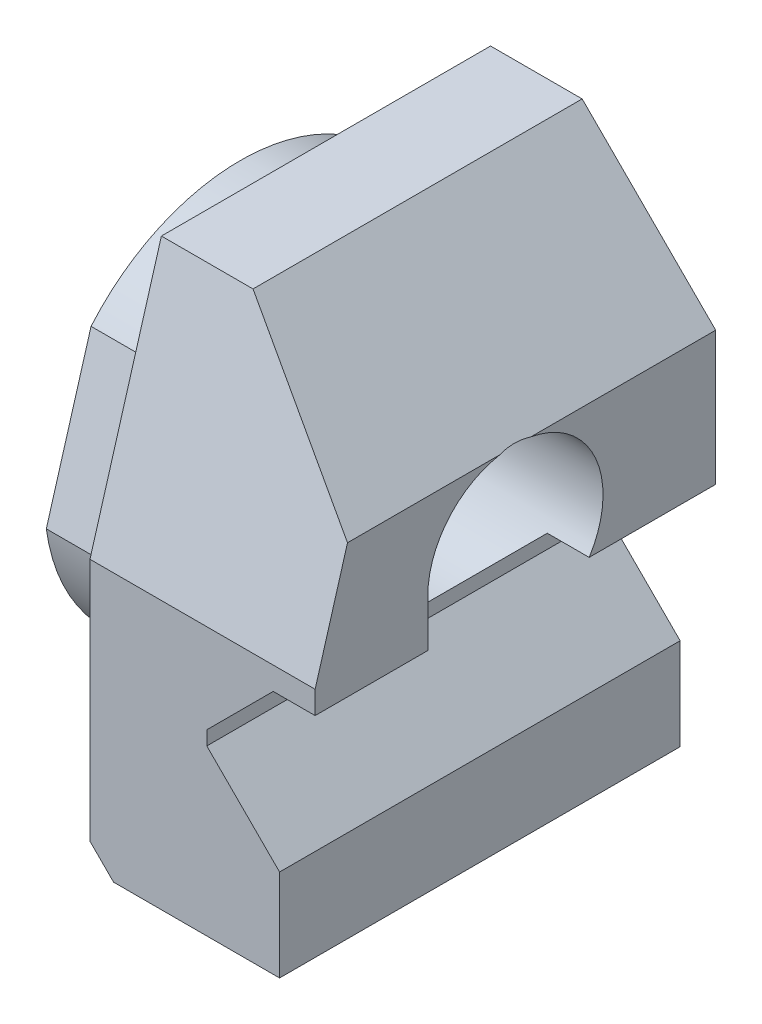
ISO-10303-21;
HEADER;
FILE_DESCRIPTION(('STEP AP214'),'2;1');
FILE_NAME('part.step','',(''),(''),'','','');
FILE_SCHEMA(('AUTOMOTIVE_DESIGN { 1 0 10303 214 1 1 1 1 }'));
ENDSEC;
DATA;
#1=APPLICATION_CONTEXT('core data for automotive mechanical design processes');
#2=APPLICATION_PROTOCOL_DEFINITION('international standard','automotive_design',2000,#1);
#3=PRODUCT_CONTEXT('',#1,'mechanical');
#4=PRODUCT('Part','Part','',(#3));
#5=PRODUCT_RELATED_PRODUCT_CATEGORY('part','',(#4));
#6=PRODUCT_DEFINITION_FORMATION('','',#4);
#7=PRODUCT_DEFINITION_CONTEXT('part definition',#1,'design');
#8=PRODUCT_DEFINITION('design','',#6,#7);
#9=PRODUCT_DEFINITION_SHAPE('','',#8);
#10=(LENGTH_UNIT() NAMED_UNIT(*) SI_UNIT(.MILLI.,.METRE.));
#11=(NAMED_UNIT(*) PLANE_ANGLE_UNIT() SI_UNIT($,.RADIAN.));
#12=(NAMED_UNIT(*) SI_UNIT($,.STERADIAN.) SOLID_ANGLE_UNIT());
#13=UNCERTAINTY_MEASURE_WITH_UNIT(LENGTH_MEASURE(1.E-05),#10,'distance_accuracy_value','');
#14=(GEOMETRIC_REPRESENTATION_CONTEXT(3) GLOBAL_UNCERTAINTY_ASSIGNED_CONTEXT((#13)) GLOBAL_UNIT_ASSIGNED_CONTEXT((#10,
#11,#12)) REPRESENTATION_CONTEXT('',''));
#15=CARTESIAN_POINT('',(0.,0.,0.));
#16=DIRECTION('',(0.,0.,1.));
#17=DIRECTION('',(1.,0.,0.));
#18=AXIS2_PLACEMENT_3D('',#15,#16,#17);
#19=CARTESIAN_POINT('',(-21.07565,12.954,15.24));
#20=DIRECTION('',(1.,0.,0.));
#21=DIRECTION('',(0.,1.,0.));
#22=AXIS2_PLACEMENT_3D('',#19,#20,#21);
#23=PLANE('',#22);
#24=DIRECTION('',(0.,-1.,0.));
#25=VECTOR('',#24,1.);
#26=CARTESIAN_POINT('',(-21.07565,12.954,15.24));
#27=LINE('',#26,#25);
#28=CARTESIAN_POINT('',(-21.07565,3.66211280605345,15.24));
#29=VERTEX_POINT('',#28);
#30=CARTESIAN_POINT('',(-21.07565,-5.62977438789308,15.24));
#31=VERTEX_POINT('',#30);
#32=EDGE_CURVE('E385',#29,#31,#27,.T.);
#33=ORIENTED_EDGE('',*,*,#32,.F.);
#34=DIRECTION('',(0.,0.959797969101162,-0.280691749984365));
#35=VECTOR('',#34,1.);
#36=CARTESIAN_POINT('',(-21.07565,12.2219121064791,12.7366970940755));
#37=LINE('',#36,#35);
#38=CARTESIAN_POINT('',(-21.07565,12.954,12.5225988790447));
#39=VERTEX_POINT('',#38);
#40=EDGE_CURVE('E352',#29,#39,#37,.T.);
#41=ORIENTED_EDGE('',*,*,#40,.T.);
#42=DIRECTION('',(0.,0.,-1.));
#43=VECTOR('',#42,1.);
#44=CARTESIAN_POINT('',(-21.07565,12.954,15.24));
#45=LINE('',#44,#43);
#46=CARTESIAN_POINT('',(-21.07565,12.954,0.));
#47=VERTEX_POINT('',#46);
#48=EDGE_CURVE('E456',#39,#47,#45,.T.);
#49=ORIENTED_EDGE('',*,*,#48,.T.);
#50=DIRECTION('',(0.,-1.,0.));
#51=VECTOR('',#50,1.);
#52=CARTESIAN_POINT('',(-21.07565,12.954,0.));
#53=LINE('',#52,#51);
#54=CARTESIAN_POINT('',(-21.07565,-5.62977438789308,0.));
#55=VERTEX_POINT('',#54);
#56=EDGE_CURVE('E553',#47,#55,#53,.T.);
#57=ORIENTED_EDGE('',*,*,#56,.T.);
#58=DIRECTION('',(0.,0.,-1.));
#59=VECTOR('',#58,1.);
#60=CARTESIAN_POINT('',(-21.07565,-5.62977438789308,15.24));
#61=LINE('',#60,#59);
#62=EDGE_CURVE('E463',#31,#55,#61,.T.);
#63=ORIENTED_EDGE('',*,*,#62,.F.);
#64=EDGE_LOOP('',(#33,#41,#49,#57,#63));
#65=FACE_BOUND('',#64,.T.);
#66=CARTESIAN_POINT('',(-21.07565,4.59292261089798,7.62));
#67=DIRECTION('',(1.,0.,0.));
#68=DIRECTION('',(0.,1.,0.));
#69=AXIS2_PLACEMENT_3D('',#66,#67,#68);
#70=CIRCLE('',#69,7.44397130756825);
#71=CARTESIAN_POINT('',(-21.07565,3.51832834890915,0.254));
#72=VERTEX_POINT('',#71);
#73=CARTESIAN_POINT('',(-21.07565,3.59081710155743,14.9962113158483));
#74=VERTEX_POINT('',#73);
#75=EDGE_CURVE('E12',#72,#74,#70,.F.);
#76=ORIENTED_EDGE('',*,*,#75,.F.);
#77=DIRECTION('',(0.,-1.,0.));
#78=VECTOR('',#77,1.);
#79=CARTESIAN_POINT('',(-21.07565,12.954,0.253999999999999));
#80=LINE('',#79,#78);
#81=CARTESIAN_POINT('',(-21.07565,5.6675168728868,0.253999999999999));
#82=VERTEX_POINT('',#81);
#83=EDGE_CURVE('E395',#82,#72,#80,.T.);
#84=ORIENTED_EDGE('',*,*,#83,.F.);
#85=CARTESIAN_POINT('',(-21.07565,4.59292261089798,7.62));
#86=DIRECTION('',(1.,0.,0.));
#87=DIRECTION('',(0.,1.,0.));
#88=AXIS2_PLACEMENT_3D('',#85,#86,#87);
#89=CIRCLE('',#88,7.44397130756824);
#90=CARTESIAN_POINT('',(-21.07565,9.41153203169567,13.2939503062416));
#91=VERTEX_POINT('',#90);
#92=EDGE_CURVE('E71',#91,#82,#89,.F.);
#93=ORIENTED_EDGE('',*,*,#92,.F.);
#94=DIRECTION('',(0.,0.959797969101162,-0.280691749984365));
#95=VECTOR('',#94,1.);
#96=CARTESIAN_POINT('',(-21.07565,12.1506164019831,12.4929084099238));
#97=LINE('',#96,#95);
#98=EDGE_CURVE('E61',#74,#91,#97,.T.);
#99=ORIENTED_EDGE('',*,*,#98,.F.);
#100=EDGE_LOOP('',(#76,#84,#93,#99));
#101=FACE_BOUND('',#100,.T.);
#102=ADVANCED_FACE('F52',(#65,#101),#23,.F.);
#103=CARTESIAN_POINT('',(-8.37564999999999,4.59292261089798,7.62));
#104=DIRECTION('',(-1.,0.,0.));
#105=DIRECTION('',(0.,-1.,0.));
#106=AXIS2_PLACEMENT_3D('',#103,#104,#105);
#107=CYLINDRICAL_SURFACE('',#106,3.33375);
#108=CARTESIAN_POINT('',(-19.80565,4.59292261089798,7.62));
#109=DIRECTION('',(-1.,0.,0.));
#110=DIRECTION('',(0.,-1.,0.));
#111=AXIS2_PLACEMENT_3D('',#108,#109,#110);
#112=CIRCLE('',#111,3.33375);
#113=CARTESIAN_POINT('',(-19.80565,1.25917261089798,7.62));
#114=VERTEX_POINT('',#113);
#115=EDGE_CURVE('E366',#114,#114,#112,.F.);
#116=ORIENTED_EDGE('',*,*,#115,.F.);
#117=EDGE_LOOP('',(#116));
#118=FACE_BOUND('',#117,.T.);
#119=DIRECTION('',(1.,0.,0.));
#120=VECTOR('',#119,1.);
#121=CARTESIAN_POINT('',(-14.10335,4.59292261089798,10.95375));
#122=LINE('',#121,#120);
#123=CARTESIAN_POINT('',(-14.10335,4.59292261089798,10.95375));
#124=VERTEX_POINT('',#123);
#125=CARTESIAN_POINT('',(-12.5095,4.59292261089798,10.95375));
#126=VERTEX_POINT('',#125);
#127=EDGE_CURVE('E340',#124,#126,#122,.T.);
#128=ORIENTED_EDGE('',*,*,#127,.F.);
#129=CARTESIAN_POINT('',(-14.10335,4.59292261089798,7.62));
#130=DIRECTION('',(-1.,0.,0.));
#131=DIRECTION('',(0.,-1.,0.));
#132=AXIS2_PLACEMENT_3D('',#129,#130,#131);
#133=CIRCLE('',#132,3.33375);
#134=CARTESIAN_POINT('',(-14.10335,2.794,10.4267359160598));
#135=VERTEX_POINT('',#134);
#136=EDGE_CURVE('E330',#135,#124,#133,.T.);
#137=ORIENTED_EDGE('',*,*,#136,.F.);
#138=CARTESIAN_POINT('',(-12.304427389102,4.59292261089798,7.62));
#139=DIRECTION('',(-0.707106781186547,0.707106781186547,0.));
#140=DIRECTION('',(-0.707106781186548,-0.707106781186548,0.));
#141=AXIS2_PLACEMENT_3D('',#138,#139,#140);
#142=ELLIPSE('',#141,4.71463446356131,3.33375);
#143=CARTESIAN_POINT('',(-14.10335,2.79399999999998,4.81326408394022));
#144=VERTEX_POINT('',#143);
#145=EDGE_CURVE('E371',#144,#135,#142,.T.);
#146=ORIENTED_EDGE('',*,*,#145,.F.);
#147=DIRECTION('',(-1.,0.,0.));
#148=VECTOR('',#147,1.);
#149=CARTESIAN_POINT('',(-8.37565,2.79399999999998,4.81326408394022));
#150=LINE('',#149,#148);
#151=CARTESIAN_POINT('',(-12.5095,2.79399999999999,4.81326408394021));
#152=VERTEX_POINT('',#151);
#153=EDGE_CURVE('E367',#152,#144,#150,.T.);
#154=ORIENTED_EDGE('',*,*,#153,.F.);
#155=CARTESIAN_POINT('',(-12.5095,4.59292261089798,7.62));
#156=DIRECTION('',(-1.,0.,0.));
#157=DIRECTION('',(0.,-1.,0.));
#158=AXIS2_PLACEMENT_3D('',#155,#156,#157);
#159=CIRCLE('',#158,3.33375);
#160=CARTESIAN_POINT('',(-12.5095,7.874,7.0297286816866));
#161=VERTEX_POINT('',#160);
#162=EDGE_CURVE('E467',#161,#152,#159,.T.);
#163=ORIENTED_EDGE('',*,*,#162,.F.);
#164=CARTESIAN_POINT('',(-9.22842261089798,4.59292261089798,7.62));
#165=DIRECTION('',(-0.707106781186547,-0.707106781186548,0.));
#166=DIRECTION('',(-0.707106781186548,0.707106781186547,0.));
#167=AXIS2_PLACEMENT_3D('',#164,#165,#166);
#168=ELLIPSE('',#167,4.7146344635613,3.33375);
#169=CARTESIAN_POINT('',(-12.5095,7.874,8.21027131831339));
#170=VERTEX_POINT('',#169);
#171=EDGE_CURVE('E375',#170,#161,#168,.T.);
#172=ORIENTED_EDGE('',*,*,#171,.F.);
#173=EDGE_CURVE('E396',#126,#170,#159,.T.);
#174=ORIENTED_EDGE('',*,*,#173,.F.);
#175=EDGE_LOOP('',(#128,#137,#146,#154,#163,#172,#174));
#176=FACE_BOUND('',#175,.T.);
#177=ADVANCED_FACE('F429',(#118,#176),#107,.F.);
#178=CARTESIAN_POINT('',(-14.10335,2.794,15.24));
#179=DIRECTION('',(0.,1.,0.));
#180=DIRECTION('',(-1.,0.,0.));
#181=AXIS2_PLACEMENT_3D('',#178,#179,#180);
#182=PLANE('',#181);
#183=DIRECTION('',(0.,0.,-1.));
#184=VECTOR('',#183,1.);
#185=CARTESIAN_POINT('',(-12.5095,2.79399999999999,15.24));
#186=LINE('',#185,#184);
#187=CARTESIAN_POINT('',(-12.5095,2.79399999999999,0.));
#188=VERTEX_POINT('',#187);
#189=EDGE_CURVE('E490',#152,#188,#186,.T.);
#190=ORIENTED_EDGE('',*,*,#189,.F.);
#191=ORIENTED_EDGE('',*,*,#153,.T.);
#192=DIRECTION('',(0.,0.,-1.));
#193=VECTOR('',#192,1.);
#194=CARTESIAN_POINT('',(-14.10335,2.794,15.24));
#195=LINE('',#194,#193);
#196=CARTESIAN_POINT('',(-14.10335,2.794,0.));
#197=VERTEX_POINT('',#196);
#198=EDGE_CURVE('E497',#144,#197,#195,.T.);
#199=ORIENTED_EDGE('',*,*,#198,.T.);
#200=DIRECTION('',(1.,0.,0.));
#201=VECTOR('',#200,1.);
#202=CARTESIAN_POINT('',(-14.10335,2.794,0.));
#203=LINE('',#202,#201);
#204=EDGE_CURVE('E564',#197,#188,#203,.T.);
#205=ORIENTED_EDGE('',*,*,#204,.T.);
#206=EDGE_LOOP('',(#190,#191,#199,#205));
#207=FACE_BOUND('',#206,.T.);
#208=ADVANCED_FACE('F435',(#207),#182,.F.);
#209=CARTESIAN_POINT('',(-12.5095,2.79399999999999,15.24));
#210=DIRECTION('',(-1.,0.,0.));
#211=DIRECTION('',(0.,-1.,0.));
#212=AXIS2_PLACEMENT_3D('',#209,#210,#211);
#213=PLANE('',#212);
#214=CARTESIAN_POINT('',(-12.5095,2.79399999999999,15.24));
#215=VERTEX_POINT('',#214);
#216=CARTESIAN_POINT('',(-12.5095,2.79399999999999,10.95375));
#217=VERTEX_POINT('',#216);
#218=EDGE_CURVE('E508',#215,#217,#186,.T.);
#219=ORIENTED_EDGE('',*,*,#218,.T.);
#220=DIRECTION('',(0.,-1.,0.));
#221=VECTOR('',#220,1.);
#222=CARTESIAN_POINT('',(-12.5095,4.59292261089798,10.95375));
#223=LINE('',#222,#221);
#224=EDGE_CURVE('E329',#126,#217,#223,.T.);
#225=ORIENTED_EDGE('',*,*,#224,.F.);
#226=ORIENTED_EDGE('',*,*,#173,.T.);
#227=DIRECTION('',(0.,0.,-1.));
#228=VECTOR('',#227,1.);
#229=CARTESIAN_POINT('',(-12.5095,7.874,15.24));
#230=LINE('',#229,#228);
#231=CARTESIAN_POINT('',(-12.5095,7.874,14.008238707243));
#232=VERTEX_POINT('',#231);
#233=EDGE_CURVE('E485',#232,#170,#230,.T.);
#234=ORIENTED_EDGE('',*,*,#233,.F.);
#235=DIRECTION('',(0.,-0.959797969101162,0.280691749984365));
#236=VECTOR('',#235,1.);
#237=CARTESIAN_POINT('',(-12.5095,2.86239674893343,15.4738759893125));
#238=LINE('',#237,#236);
#239=CARTESIAN_POINT('',(-12.5095,3.66211280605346,15.24));
#240=VERTEX_POINT('',#239);
#241=EDGE_CURVE('E362',#232,#240,#238,.T.);
#242=ORIENTED_EDGE('',*,*,#241,.T.);
#243=DIRECTION('',(0.,1.,0.));
#244=VECTOR('',#243,1.);
#245=CARTESIAN_POINT('',(-12.5095,2.79399999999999,15.24));
#246=LINE('',#245,#244);
#247=EDGE_CURVE('E577',#215,#240,#246,.T.);
#248=ORIENTED_EDGE('',*,*,#247,.F.);
#249=EDGE_LOOP('',(#219,#225,#226,#234,#242,#248));
#250=FACE_BOUND('',#249,.T.);
#251=ADVANCED_FACE('F451',(#250),#213,.F.);
#252=CARTESIAN_POINT('',(-12.5095,7.874,15.24));
#253=DIRECTION('',(-0.707106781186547,-0.707106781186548,0.));
#254=DIRECTION('',(0.707106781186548,-0.707106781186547,0.));
#255=AXIS2_PLACEMENT_3D('',#252,#253,#254);
#256=PLANE('',#255);
#257=DIRECTION('',(0.,0.,-1.));
#258=VECTOR('',#257,1.);
#259=CARTESIAN_POINT('',(-17.5895,12.954,15.24));
#260=LINE('',#259,#258);
#261=CARTESIAN_POINT('',(-17.5895,12.954,12.5225988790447));
#262=VERTEX_POINT('',#261);
#263=CARTESIAN_POINT('',(-17.5895,12.954,0.));
#264=VERTEX_POINT('',#263);
#265=EDGE_CURVE('E462',#262,#264,#260,.T.);
#266=ORIENTED_EDGE('',*,*,#265,.F.);
#267=DIRECTION('',(0.69245597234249,-0.69245597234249,0.202507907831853));
#268=VECTOR('',#267,1.);
#269=CARTESIAN_POINT('',(-12.3367728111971,7.70127281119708,14.0587525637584));
#270=LINE('',#269,#268);
#271=EDGE_CURVE('E356',#262,#232,#270,.T.);
#272=ORIENTED_EDGE('',*,*,#271,.T.);
#273=ORIENTED_EDGE('',*,*,#233,.T.);
#274=ORIENTED_EDGE('',*,*,#171,.T.);
#275=CARTESIAN_POINT('',(-12.5095,7.874,0.));
#276=VERTEX_POINT('',#275);
#277=EDGE_CURVE('E491',#161,#276,#230,.T.);
#278=ORIENTED_EDGE('',*,*,#277,.T.);
#279=DIRECTION('',(-0.707106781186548,0.707106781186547,0.));
#280=VECTOR('',#279,1.);
#281=CARTESIAN_POINT('',(-12.5095,7.874,0.));
#282=LINE('',#281,#280);
#283=EDGE_CURVE('E379',#276,#264,#282,.T.);
#284=ORIENTED_EDGE('',*,*,#283,.T.);
#285=EDGE_LOOP('',(#266,#272,#273,#274,#278,#284));
#286=FACE_BOUND('',#285,.T.);
#287=ADVANCED_FACE('F54',(#286),#256,.F.);
#288=CARTESIAN_POINT('',(-17.5895,12.954,15.24));
#289=DIRECTION('',(0.,-1.,0.));
#290=DIRECTION('',(0.,0.,-1.));
#291=AXIS2_PLACEMENT_3D('',#288,#289,#290);
#292=PLANE('',#291);
#293=ORIENTED_EDGE('',*,*,#48,.F.);
#294=DIRECTION('',(-1.,0.,0.));
#295=VECTOR('',#294,1.);
#296=CARTESIAN_POINT('',(15.049561,12.954,12.5225988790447));
#297=LINE('',#296,#295);
#298=EDGE_CURVE('E347',#262,#39,#297,.T.);
#299=ORIENTED_EDGE('',*,*,#298,.F.);
#300=ORIENTED_EDGE('',*,*,#265,.T.);
#301=DIRECTION('',(-1.,0.,0.));
#302=VECTOR('',#301,1.);
#303=CARTESIAN_POINT('',(-17.5895,12.954,0.));
#304=LINE('',#303,#302);
#305=EDGE_CURVE('E459',#264,#47,#304,.T.);
#306=ORIENTED_EDGE('',*,*,#305,.T.);
#307=EDGE_LOOP('',(#293,#299,#300,#306));
#308=FACE_BOUND('',#307,.T.);
#309=ADVANCED_FACE('F442',(#308),#292,.F.);
#310=CARTESIAN_POINT('',(-21.07565,-5.62977438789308,15.24));
#311=DIRECTION('',(0.707106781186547,0.707106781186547,0.));
#312=DIRECTION('',(-0.707106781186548,0.707106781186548,0.));
#313=AXIS2_PLACEMENT_3D('',#310,#311,#312);
#314=PLANE('',#313);
#315=DIRECTION('',(0.707106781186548,-0.707106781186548,0.));
#316=VECTOR('',#315,1.);
#317=CARTESIAN_POINT('',(-21.07565,-5.62977438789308,0.));
#318=LINE('',#317,#316);
#319=CARTESIAN_POINT('',(-20.1776243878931,-6.5278,0.));
#320=VERTEX_POINT('',#319);
#321=EDGE_CURVE('E544',#55,#320,#318,.T.);
#322=ORIENTED_EDGE('',*,*,#321,.T.);
#323=DIRECTION('',(0.,0.,-1.));
#324=VECTOR('',#323,1.);
#325=CARTESIAN_POINT('',(-20.1776243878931,-6.5278,15.24));
#326=LINE('',#325,#324);
#327=CARTESIAN_POINT('',(-20.1776243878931,-6.5278,15.24));
#328=VERTEX_POINT('',#327);
#329=EDGE_CURVE('E470',#328,#320,#326,.T.);
#330=ORIENTED_EDGE('',*,*,#329,.F.);
#331=DIRECTION('',(0.707106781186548,-0.707106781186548,0.));
#332=VECTOR('',#331,1.);
#333=CARTESIAN_POINT('',(-21.07565,-5.62977438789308,15.24));
#334=LINE('',#333,#332);
#335=EDGE_CURVE('E382',#31,#328,#334,.T.);
#336=ORIENTED_EDGE('',*,*,#335,.F.);
#337=ORIENTED_EDGE('',*,*,#62,.T.);
#338=EDGE_LOOP('',(#322,#330,#336,#337));
#339=FACE_BOUND('',#338,.T.);
#340=ADVANCED_FACE('F440',(#339),#314,.F.);
#341=CARTESIAN_POINT('',(-20.1776243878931,-6.5278,15.24));
#342=DIRECTION('',(0.,1.,0.));
#343=DIRECTION('',(0.,0.,1.));
#344=AXIS2_PLACEMENT_3D('',#341,#342,#343);
#345=PLANE('',#344);
#346=DIRECTION('',(1.,0.,0.));
#347=VECTOR('',#346,1.);
#348=CARTESIAN_POINT('',(-20.1776243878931,-6.5278,0.));
#349=LINE('',#348,#347);
#350=CARTESIAN_POINT('',(-13.86205,-6.5278,0.));
#351=VERTEX_POINT('',#350);
#352=EDGE_CURVE('E536',#320,#351,#349,.T.);
#353=ORIENTED_EDGE('',*,*,#352,.T.);
#354=DIRECTION('',(0.,0.,-1.));
#355=VECTOR('',#354,1.);
#356=CARTESIAN_POINT('',(-13.86205,-6.5278,15.24));
#357=LINE('',#356,#355);
#358=CARTESIAN_POINT('',(-13.86205,-6.5278,15.24));
#359=VERTEX_POINT('',#358);
#360=EDGE_CURVE('E526',#359,#351,#357,.T.);
#361=ORIENTED_EDGE('',*,*,#360,.F.);
#362=DIRECTION('',(1.,0.,0.));
#363=VECTOR('',#362,1.);
#364=CARTESIAN_POINT('',(-20.1776243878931,-6.5278,15.24));
#365=LINE('',#364,#363);
#366=EDGE_CURVE('E537',#328,#359,#365,.T.);
#367=ORIENTED_EDGE('',*,*,#366,.F.);
#368=ORIENTED_EDGE('',*,*,#329,.T.);
#369=EDGE_LOOP('',(#353,#361,#367,#368));
#370=FACE_BOUND('',#369,.T.);
#371=ADVANCED_FACE('F449',(#370),#345,.F.);
#372=CARTESIAN_POINT('',(-13.86205,-6.5278,15.24));
#373=DIRECTION('',(-1.,0.,0.));
#374=DIRECTION('',(0.,0.,1.));
#375=AXIS2_PLACEMENT_3D('',#372,#373,#374);
#376=PLANE('',#375);
#377=DIRECTION('',(0.,1.,0.));
#378=VECTOR('',#377,1.);
#379=CARTESIAN_POINT('',(-13.86205,-6.5278,0.));
#380=LINE('',#379,#378);
#381=CARTESIAN_POINT('',(-13.86205,-3.03530000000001,0.));
#382=VERTEX_POINT('',#381);
#383=EDGE_CURVE('E546',#351,#382,#380,.T.);
#384=ORIENTED_EDGE('',*,*,#383,.T.);
#385=DIRECTION('',(0.,0.,-1.));
#386=VECTOR('',#385,1.);
#387=CARTESIAN_POINT('',(-13.86205,-3.03530000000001,15.24));
#388=LINE('',#387,#386);
#389=CARTESIAN_POINT('',(-13.86205,-3.03530000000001,15.24));
#390=VERTEX_POINT('',#389);
#391=EDGE_CURVE('E522',#390,#382,#388,.T.);
#392=ORIENTED_EDGE('',*,*,#391,.F.);
#393=DIRECTION('',(0.,1.,0.));
#394=VECTOR('',#393,1.);
#395=CARTESIAN_POINT('',(-13.86205,-6.5278,15.24));
#396=LINE('',#395,#394);
#397=EDGE_CURVE('E584',#359,#390,#396,.T.);
#398=ORIENTED_EDGE('',*,*,#397,.F.);
#399=ORIENTED_EDGE('',*,*,#360,.T.);
#400=EDGE_LOOP('',(#384,#392,#398,#399));
#401=FACE_BOUND('',#400,.T.);
#402=ADVANCED_FACE('F642',(#401),#376,.F.);
#403=CARTESIAN_POINT('',(-13.86205,-3.03530000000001,15.24));
#404=DIRECTION('',(-0.707106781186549,-0.707106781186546,0.));
#405=DIRECTION('',(0.707106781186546,-0.707106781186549,0.));
#406=AXIS2_PLACEMENT_3D('',#403,#404,#405);
#407=PLANE('',#406);
#408=DIRECTION('',(-0.707106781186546,0.707106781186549,0.));
#409=VECTOR('',#408,1.);
#410=CARTESIAN_POINT('',(-13.86205,-3.03530000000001,0.));
#411=LINE('',#410,#409);
#412=CARTESIAN_POINT('',(-16.63065,-0.266699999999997,0.));
#413=VERTEX_POINT('',#412);
#414=EDGE_CURVE('E551',#382,#413,#411,.T.);
#415=ORIENTED_EDGE('',*,*,#414,.T.);
#416=DIRECTION('',(0.,0.,-1.));
#417=VECTOR('',#416,1.);
#418=CARTESIAN_POINT('',(-16.63065,-0.266699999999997,15.24));
#419=LINE('',#418,#417);
#420=CARTESIAN_POINT('',(-16.63065,-0.266699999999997,15.24));
#421=VERTEX_POINT('',#420);
#422=EDGE_CURVE('E518',#421,#413,#419,.T.);
#423=ORIENTED_EDGE('',*,*,#422,.F.);
#424=DIRECTION('',(-0.707106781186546,0.707106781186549,0.));
#425=VECTOR('',#424,1.);
#426=CARTESIAN_POINT('',(-13.86205,-3.03530000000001,15.24));
#427=LINE('',#426,#425);
#428=EDGE_CURVE('E586',#390,#421,#427,.T.);
#429=ORIENTED_EDGE('',*,*,#428,.F.);
#430=ORIENTED_EDGE('',*,*,#391,.T.);
#431=EDGE_LOOP('',(#415,#423,#429,#430));
#432=FACE_BOUND('',#431,.T.);
#433=ADVANCED_FACE('F638',(#432),#407,.F.);
#434=CARTESIAN_POINT('',(-16.63065,-0.266699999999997,15.24));
#435=DIRECTION('',(-1.,0.,0.));
#436=DIRECTION('',(0.,0.,1.));
#437=AXIS2_PLACEMENT_3D('',#434,#435,#436);
#438=PLANE('',#437);
#439=DIRECTION('',(0.,1.,0.));
#440=VECTOR('',#439,1.);
#441=CARTESIAN_POINT('',(-16.63065,-0.266699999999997,0.));
#442=LINE('',#441,#440);
#443=CARTESIAN_POINT('',(-16.63065,0.266699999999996,0.));
#444=VERTEX_POINT('',#443);
#445=EDGE_CURVE('E559',#413,#444,#442,.T.);
#446=ORIENTED_EDGE('',*,*,#445,.T.);
#447=DIRECTION('',(0.,0.,-1.));
#448=VECTOR('',#447,1.);
#449=CARTESIAN_POINT('',(-16.63065,0.266699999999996,15.24));
#450=LINE('',#449,#448);
#451=CARTESIAN_POINT('',(-16.63065,0.266699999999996,15.24));
#452=VERTEX_POINT('',#451);
#453=EDGE_CURVE('E513',#452,#444,#450,.T.);
#454=ORIENTED_EDGE('',*,*,#453,.F.);
#455=DIRECTION('',(0.,1.,0.));
#456=VECTOR('',#455,1.);
#457=CARTESIAN_POINT('',(-16.63065,-0.266699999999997,15.24));
#458=LINE('',#457,#456);
#459=EDGE_CURVE('E591',#421,#452,#458,.T.);
#460=ORIENTED_EDGE('',*,*,#459,.F.);
#461=ORIENTED_EDGE('',*,*,#422,.T.);
#462=EDGE_LOOP('',(#446,#454,#460,#461));
#463=FACE_BOUND('',#462,.T.);
#464=ADVANCED_FACE('F635',(#463),#438,.F.);
#465=CARTESIAN_POINT('',(-16.63065,0.266699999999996,15.24));
#466=DIRECTION('',(-0.707106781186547,0.707106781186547,0.));
#467=DIRECTION('',(-0.707106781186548,-0.707106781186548,0.));
#468=AXIS2_PLACEMENT_3D('',#465,#466,#467);
#469=PLANE('',#468);
#470=ORIENTED_EDGE('',*,*,#198,.F.);
#471=ORIENTED_EDGE('',*,*,#145,.T.);
#472=DIRECTION('',(0.,0.,-1.));
#473=VECTOR('',#472,1.);
#474=CARTESIAN_POINT('',(-14.10335,2.79399999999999,10.95375));
#475=LINE('',#474,#473);
#476=CARTESIAN_POINT('',(-14.10335,2.794,10.95375));
#477=VERTEX_POINT('',#476);
#478=EDGE_CURVE('E337',#477,#135,#475,.T.);
#479=ORIENTED_EDGE('',*,*,#478,.F.);
#480=CARTESIAN_POINT('',(-14.10335,2.794,15.24));
#481=VERTEX_POINT('',#480);
#482=EDGE_CURVE('E507',#481,#477,#195,.T.);
#483=ORIENTED_EDGE('',*,*,#482,.F.);
#484=DIRECTION('',(0.707106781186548,0.707106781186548,0.));
#485=VECTOR('',#484,1.);
#486=CARTESIAN_POINT('',(-16.63065,0.266699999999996,15.24));
#487=LINE('',#486,#485);
#488=EDGE_CURVE('E594',#452,#481,#487,.T.);
#489=ORIENTED_EDGE('',*,*,#488,.F.);
#490=ORIENTED_EDGE('',*,*,#453,.T.);
#491=DIRECTION('',(0.707106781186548,0.707106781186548,0.));
#492=VECTOR('',#491,1.);
#493=CARTESIAN_POINT('',(-16.63065,0.266699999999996,0.));
#494=LINE('',#493,#492);
#495=EDGE_CURVE('E504',#444,#197,#494,.T.);
#496=ORIENTED_EDGE('',*,*,#495,.T.);
#497=EDGE_LOOP('',(#470,#471,#479,#483,#489,#490,#496));
#498=FACE_BOUND('',#497,.T.);
#499=ADVANCED_FACE('F500',(#498),#469,.F.);
#500=ORIENTED_EDGE('',*,*,#482,.T.);
#501=DIRECTION('',(1.,0.,0.));
#502=VECTOR('',#501,1.);
#503=CARTESIAN_POINT('',(-14.10335,2.79399999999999,10.95375));
#504=LINE('',#503,#502);
#505=EDGE_CURVE('E343',#477,#217,#504,.T.);
#506=ORIENTED_EDGE('',*,*,#505,.T.);
#507=ORIENTED_EDGE('',*,*,#218,.F.);
#508=DIRECTION('',(1.,0.,0.));
#509=VECTOR('',#508,1.);
#510=CARTESIAN_POINT('',(-14.10335,2.794,15.24));
#511=LINE('',#510,#509);
#512=EDGE_CURVE('E596',#481,#215,#511,.T.);
#513=ORIENTED_EDGE('',*,*,#512,.F.);
#514=EDGE_LOOP('',(#500,#506,#507,#513));
#515=FACE_BOUND('',#514,.T.);
#516=ADVANCED_FACE('F629',(#515),#182,.F.);
#517=ORIENTED_EDGE('',*,*,#277,.F.);
#518=ORIENTED_EDGE('',*,*,#162,.T.);
#519=ORIENTED_EDGE('',*,*,#189,.T.);
#520=DIRECTION('',(0.,1.,0.));
#521=VECTOR('',#520,1.);
#522=CARTESIAN_POINT('',(-12.5095,2.79399999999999,0.));
#523=LINE('',#522,#521);
#524=EDGE_CURVE('E389',#188,#276,#523,.T.);
#525=ORIENTED_EDGE('',*,*,#524,.T.);
#526=EDGE_LOOP('',(#517,#518,#519,#525));
#527=FACE_BOUND('',#526,.T.);
#528=ADVANCED_FACE('F570',(#527),#213,.F.);
#529=CARTESIAN_POINT('',(0.,0.,15.24));
#530=DIRECTION('',(0.,0.,-1.));
#531=DIRECTION('',(-1.,0.,0.));
#532=AXIS2_PLACEMENT_3D('',#529,#530,#531);
#533=PLANE('',#532);
#534=ORIENTED_EDGE('',*,*,#247,.T.);
#535=DIRECTION('',(-1.,0.,0.));
#536=VECTOR('',#535,1.);
#537=CARTESIAN_POINT('',(0.,3.66211280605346,15.24));
#538=LINE('',#537,#536);
#539=EDGE_CURVE('E391',#240,#29,#538,.T.);
#540=ORIENTED_EDGE('',*,*,#539,.T.);
#541=ORIENTED_EDGE('',*,*,#32,.T.);
#542=ORIENTED_EDGE('',*,*,#335,.T.);
#543=ORIENTED_EDGE('',*,*,#366,.T.);
#544=ORIENTED_EDGE('',*,*,#397,.T.);
#545=ORIENTED_EDGE('',*,*,#428,.T.);
#546=ORIENTED_EDGE('',*,*,#459,.T.);
#547=ORIENTED_EDGE('',*,*,#488,.T.);
#548=ORIENTED_EDGE('',*,*,#512,.T.);
#549=EDGE_LOOP('',(#534,#540,#541,#542,#543,#544,#545,#546,#547,#548));
#550=FACE_BOUND('',#549,.T.);
#551=ADVANCED_FACE('F605',(#550),#533,.F.);
#552=CARTESIAN_POINT('',(0.,0.,0.));
#553=DIRECTION('',(0.,0.,-1.));
#554=DIRECTION('',(-1.,0.,0.));
#555=AXIS2_PLACEMENT_3D('',#552,#553,#554);
#556=PLANE('',#555);
#557=ORIENTED_EDGE('',*,*,#283,.F.);
#558=ORIENTED_EDGE('',*,*,#524,.F.);
#559=ORIENTED_EDGE('',*,*,#204,.F.);
#560=ORIENTED_EDGE('',*,*,#495,.F.);
#561=ORIENTED_EDGE('',*,*,#445,.F.);
#562=ORIENTED_EDGE('',*,*,#414,.F.);
#563=ORIENTED_EDGE('',*,*,#383,.F.);
#564=ORIENTED_EDGE('',*,*,#352,.F.);
#565=ORIENTED_EDGE('',*,*,#321,.F.);
#566=ORIENTED_EDGE('',*,*,#56,.F.);
#567=ORIENTED_EDGE('',*,*,#305,.F.);
#568=EDGE_LOOP('',(#557,#558,#559,#560,#561,#562,#563,#564,#565,#566,#567));
#569=FACE_BOUND('',#568,.T.);
#570=ADVANCED_FACE('F543',(#569),#556,.T.);
#571=CARTESIAN_POINT('',(-19.80565,4.59292261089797,7.62));
#572=DIRECTION('',(-1.,0.,0.));
#573=DIRECTION('',(0.,-1.,0.));
#574=AXIS2_PLACEMENT_3D('',#571,#572,#573);
#575=PLANE('',#574);
#576=DIRECTION('',(0.,0.866025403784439,0.5));
#577=VECTOR('',#576,1.);
#578=CARTESIAN_POINT('',(-19.80565,-0.645827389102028,10.6445937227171));
#579=LINE('',#578,#577);
#580=CARTESIAN_POINT('',(-19.80565,-0.645827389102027,10.6445937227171));
#581=VERTEX_POINT('',#580);
#582=CARTESIAN_POINT('',(-19.80565,4.59292261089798,13.6691874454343));
#583=VERTEX_POINT('',#582);
#584=EDGE_CURVE('E269',#581,#583,#579,.T.);
#585=ORIENTED_EDGE('',*,*,#584,.T.);
#586=DIRECTION('',(0.,0.866025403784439,-0.5));
#587=VECTOR('',#586,1.);
#588=CARTESIAN_POINT('',(-19.80565,4.59292261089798,13.6691874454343));
#589=LINE('',#588,#587);
#590=CARTESIAN_POINT('',(-19.80565,9.83167261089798,10.6445937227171));
#591=VERTEX_POINT('',#590);
#592=EDGE_CURVE('E245',#583,#591,#589,.T.);
#593=ORIENTED_EDGE('',*,*,#592,.T.);
#594=DIRECTION('',(0.,0.,-1.));
#595=VECTOR('',#594,1.);
#596=CARTESIAN_POINT('',(-19.80565,9.83167261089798,10.6445937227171));
#597=LINE('',#596,#595);
#598=CARTESIAN_POINT('',(-19.80565,9.83167261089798,4.59540627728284));
#599=VERTEX_POINT('',#598);
#600=EDGE_CURVE('E274',#591,#599,#597,.T.);
#601=ORIENTED_EDGE('',*,*,#600,.T.);
#602=DIRECTION('',(0.,-0.866025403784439,-0.5));
#603=VECTOR('',#602,1.);
#604=CARTESIAN_POINT('',(-19.80565,9.83167261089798,4.59540627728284));
#605=LINE('',#604,#603);
#606=CARTESIAN_POINT('',(-19.80565,4.59292261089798,1.57081255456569));
#607=VERTEX_POINT('',#606);
#608=EDGE_CURVE('E277',#599,#607,#605,.T.);
#609=ORIENTED_EDGE('',*,*,#608,.T.);
#610=DIRECTION('',(0.,-0.866025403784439,0.5));
#611=VECTOR('',#610,1.);
#612=CARTESIAN_POINT('',(-19.80565,4.59292261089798,1.57081255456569));
#613=LINE('',#612,#611);
#614=CARTESIAN_POINT('',(-19.80565,-0.645827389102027,4.59540627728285));
#615=VERTEX_POINT('',#614);
#616=EDGE_CURVE('E280',#607,#615,#613,.T.);
#617=ORIENTED_EDGE('',*,*,#616,.T.);
#618=DIRECTION('',(0.,0.,1.));
#619=VECTOR('',#618,1.);
#620=CARTESIAN_POINT('',(-19.80565,-0.645827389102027,4.59540627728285));
#621=LINE('',#620,#619);
#622=EDGE_CURVE('E238',#615,#581,#621,.T.);
#623=ORIENTED_EDGE('',*,*,#622,.T.);
#624=EDGE_LOOP('',(#585,#593,#601,#609,#617,#623));
#625=FACE_BOUND('',#624,.T.);
#626=ORIENTED_EDGE('',*,*,#115,.T.);
#627=EDGE_LOOP('',(#626));
#628=FACE_BOUND('',#627,.T.);
#629=ADVANCED_FACE('F610',(#625,#628),#575,.T.);
#630=CARTESIAN_POINT('',(15.049561,3.66211280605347,15.24));
#631=DIRECTION('',(0.,-0.280691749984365,-0.959797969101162));
#632=DIRECTION('',(0.,0.959797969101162,-0.280691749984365));
#633=AXIS2_PLACEMENT_3D('',#630,#631,#632);
#634=PLANE('',#633);
#635=ORIENTED_EDGE('',*,*,#271,.F.);
#636=ORIENTED_EDGE('',*,*,#298,.T.);
#637=ORIENTED_EDGE('',*,*,#40,.F.);
#638=ORIENTED_EDGE('',*,*,#539,.F.);
#639=ORIENTED_EDGE('',*,*,#241,.F.);
#640=EDGE_LOOP('',(#635,#636,#637,#638,#639));
#641=FACE_BOUND('',#640,.T.);
#642=ADVANCED_FACE('F607',(#641),#634,.F.);
#643=CARTESIAN_POINT('',(-14.10335,4.59292261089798,10.95375));
#644=DIRECTION('',(0.,0.,1.));
#645=DIRECTION('',(1.,0.,0.));
#646=AXIS2_PLACEMENT_3D('',#643,#644,#645);
#647=PLANE('',#646);
#648=ORIENTED_EDGE('',*,*,#224,.T.);
#649=ORIENTED_EDGE('',*,*,#505,.F.);
#650=DIRECTION('',(0.,-1.,0.));
#651=VECTOR('',#650,1.);
#652=CARTESIAN_POINT('',(-14.10335,4.59292261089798,10.95375));
#653=LINE('',#652,#651);
#654=EDGE_CURVE('E334',#124,#477,#653,.T.);
#655=ORIENTED_EDGE('',*,*,#654,.F.);
#656=ORIENTED_EDGE('',*,*,#127,.T.);
#657=EDGE_LOOP('',(#648,#649,#655,#656));
#658=FACE_BOUND('',#657,.T.);
#659=ADVANCED_FACE('F609',(#658),#647,.F.);
#660=CARTESIAN_POINT('',(-14.10335,4.59292261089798,7.62));
#661=DIRECTION('',(-1.,0.,0.));
#662=DIRECTION('',(0.,-1.,0.));
#663=AXIS2_PLACEMENT_3D('',#660,#661,#662);
#664=PLANE('',#663);
#665=ORIENTED_EDGE('',*,*,#136,.T.);
#666=ORIENTED_EDGE('',*,*,#654,.T.);
#667=ORIENTED_EDGE('',*,*,#478,.T.);
#668=EDGE_LOOP('',(#665,#666,#667));
#669=FACE_BOUND('',#668,.T.);
#670=ADVANCED_FACE('F616',(#669),#664,.F.);
#671=CARTESIAN_POINT('',(-22.98065,4.59292261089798,7.62));
#672=DIRECTION('',(1.,0.,0.));
#673=DIRECTION('',(0.,1.,0.));
#674=AXIS2_PLACEMENT_3D('',#671,#672,#673);
#675=CYLINDRICAL_SURFACE('',#674,7.44397130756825);
#676=DIRECTION('',(1.,0.,0.));
#677=VECTOR('',#676,1.);
#678=CARTESIAN_POINT('',(-22.98065,3.51832834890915,0.254));
#679=LINE('',#678,#677);
#680=CARTESIAN_POINT('',(-22.98065,3.51832834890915,0.254));
#681=VERTEX_POINT('',#680);
#682=EDGE_CURVE('E313',#681,#72,#679,.T.);
#683=ORIENTED_EDGE('',*,*,#682,.T.);
#684=ORIENTED_EDGE('',*,*,#75,.T.);
#685=DIRECTION('',(1.,0.,0.));
#686=VECTOR('',#685,1.);
#687=CARTESIAN_POINT('',(-22.98065,3.59081710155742,14.9962113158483));
#688=LINE('',#687,#686);
#689=CARTESIAN_POINT('',(-22.98065,3.59081710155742,14.9962113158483));
#690=VERTEX_POINT('',#689);
#691=EDGE_CURVE('E325',#690,#74,#688,.T.);
#692=ORIENTED_EDGE('',*,*,#691,.F.);
#693=CARTESIAN_POINT('',(-22.98065,4.59292261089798,7.62));
#694=DIRECTION('',(-1.,0.,0.));
#695=DIRECTION('',(0.,-1.,0.));
#696=AXIS2_PLACEMENT_3D('',#693,#694,#695);
#697=CIRCLE('',#696,7.44397130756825);
#698=EDGE_CURVE('E247',#681,#690,#697,.T.);
#699=ORIENTED_EDGE('',*,*,#698,.F.);
#700=EDGE_LOOP('',(#683,#684,#692,#699));
#701=FACE_BOUND('',#700,.T.);
#702=ADVANCED_FACE('F417',(#701),#675,.T.);
#703=CARTESIAN_POINT('',(-22.98065,3.59081710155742,14.9962113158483));
#704=DIRECTION('',(0.,-0.280691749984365,-0.959797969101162));
#705=DIRECTION('',(0.,0.959797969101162,-0.280691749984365));
#706=AXIS2_PLACEMENT_3D('',#703,#704,#705);
#707=PLANE('',#706);
#708=ORIENTED_EDGE('',*,*,#691,.T.);
#709=ORIENTED_EDGE('',*,*,#98,.T.);
#710=DIRECTION('',(1.,0.,0.));
#711=VECTOR('',#710,1.);
#712=CARTESIAN_POINT('',(-22.98065,9.41153203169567,13.2939503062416));
#713=LINE('',#712,#711);
#714=CARTESIAN_POINT('',(-22.98065,9.41153203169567,13.2939503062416));
#715=VERTEX_POINT('',#714);
#716=EDGE_CURVE('E321',#715,#91,#713,.T.);
#717=ORIENTED_EDGE('',*,*,#716,.F.);
#718=DIRECTION('',(0.,0.959797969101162,-0.280691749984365));
#719=VECTOR('',#718,1.);
#720=CARTESIAN_POINT('',(-22.98065,3.59081710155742,14.9962113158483));
#721=LINE('',#720,#719);
#722=EDGE_CURVE('E304',#690,#715,#721,.T.);
#723=ORIENTED_EDGE('',*,*,#722,.F.);
#724=EDGE_LOOP('',(#708,#709,#717,#723));
#725=FACE_BOUND('',#724,.T.);
#726=ADVANCED_FACE('F406',(#725),#707,.F.);
#727=CARTESIAN_POINT('',(-22.98065,4.59292261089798,7.62));
#728=DIRECTION('',(1.,0.,0.));
#729=DIRECTION('',(0.,1.,0.));
#730=AXIS2_PLACEMENT_3D('',#727,#728,#729);
#731=CYLINDRICAL_SURFACE('',#730,7.44397130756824);
#732=ORIENTED_EDGE('',*,*,#716,.T.);
#733=ORIENTED_EDGE('',*,*,#92,.T.);
#734=DIRECTION('',(1.,0.,0.));
#735=VECTOR('',#734,1.);
#736=CARTESIAN_POINT('',(-22.98065,5.6675168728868,0.253999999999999));
#737=LINE('',#736,#735);
#738=CARTESIAN_POINT('',(-22.98065,5.6675168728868,0.253999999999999));
#739=VERTEX_POINT('',#738);
#740=EDGE_CURVE('E317',#739,#82,#737,.T.);
#741=ORIENTED_EDGE('',*,*,#740,.F.);
#742=CARTESIAN_POINT('',(-22.98065,4.59292261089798,7.62));
#743=DIRECTION('',(-1.,0.,0.));
#744=DIRECTION('',(0.,-1.,0.));
#745=AXIS2_PLACEMENT_3D('',#742,#743,#744);
#746=CIRCLE('',#745,7.44397130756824);
#747=EDGE_CURVE('E307',#715,#739,#746,.T.);
#748=ORIENTED_EDGE('',*,*,#747,.F.);
#749=EDGE_LOOP('',(#732,#733,#741,#748));
#750=FACE_BOUND('',#749,.T.);
#751=ADVANCED_FACE('F410',(#750),#731,.T.);
#752=CARTESIAN_POINT('',(-22.98065,5.6675168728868,0.254));
#753=DIRECTION('',(0.,0.,1.));
#754=DIRECTION('',(1.,0.,0.));
#755=AXIS2_PLACEMENT_3D('',#752,#753,#754);
#756=PLANE('',#755);
#757=ORIENTED_EDGE('',*,*,#740,.T.);
#758=ORIENTED_EDGE('',*,*,#83,.T.);
#759=ORIENTED_EDGE('',*,*,#682,.F.);
#760=DIRECTION('',(0.,-1.,0.));
#761=VECTOR('',#760,1.);
#762=CARTESIAN_POINT('',(-22.98065,5.6675168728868,0.254));
#763=LINE('',#762,#761);
#764=EDGE_CURVE('E310',#739,#681,#763,.T.);
#765=ORIENTED_EDGE('',*,*,#764,.F.);
#766=EDGE_LOOP('',(#757,#758,#759,#765));
#767=FACE_BOUND('',#766,.T.);
#768=ADVANCED_FACE('F419',(#767),#756,.F.);
#769=CARTESIAN_POINT('',(-22.98065,4.59292261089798,7.62));
#770=DIRECTION('',(-1.,0.,0.));
#771=DIRECTION('',(0.,-1.,0.));
#772=AXIS2_PLACEMENT_3D('',#769,#770,#771);
#773=PLANE('',#772);
#774=ORIENTED_EDGE('',*,*,#698,.T.);
#775=ORIENTED_EDGE('',*,*,#722,.T.);
#776=ORIENTED_EDGE('',*,*,#747,.T.);
#777=ORIENTED_EDGE('',*,*,#764,.T.);
#778=EDGE_LOOP('',(#774,#775,#776,#777));
#779=FACE_BOUND('',#778,.T.);
#780=DIRECTION('',(0.,0.866025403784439,-0.5));
#781=VECTOR('',#780,1.);
#782=CARTESIAN_POINT('',(-22.98065,4.59292261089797,13.6691874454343));
#783=LINE('',#782,#781);
#784=CARTESIAN_POINT('',(-22.98065,4.59292261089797,13.6691874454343));
#785=VERTEX_POINT('',#784);
#786=CARTESIAN_POINT('',(-22.98065,9.83167261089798,10.6445937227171));
#787=VERTEX_POINT('',#786);
#788=EDGE_CURVE('E237',#785,#787,#783,.T.);
#789=ORIENTED_EDGE('',*,*,#788,.F.);
#790=DIRECTION('',(0.,0.866025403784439,0.5));
#791=VECTOR('',#790,1.);
#792=CARTESIAN_POINT('',(-22.98065,-0.645827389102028,10.6445937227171));
#793=LINE('',#792,#791);
#794=CARTESIAN_POINT('',(-22.98065,-0.645827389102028,10.6445937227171));
#795=VERTEX_POINT('',#794);
#796=EDGE_CURVE('E226',#795,#785,#793,.T.);
#797=ORIENTED_EDGE('',*,*,#796,.F.);
#798=DIRECTION('',(0.,0.,1.));
#799=VECTOR('',#798,1.);
#800=CARTESIAN_POINT('',(-22.98065,-0.645827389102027,4.59540627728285));
#801=LINE('',#800,#799);
#802=CARTESIAN_POINT('',(-22.98065,-0.645827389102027,4.59540627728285));
#803=VERTEX_POINT('',#802);
#804=EDGE_CURVE('E266',#803,#795,#801,.T.);
#805=ORIENTED_EDGE('',*,*,#804,.F.);
#806=DIRECTION('',(0.,-0.866025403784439,0.5));
#807=VECTOR('',#806,1.);
#808=CARTESIAN_POINT('',(-22.98065,4.59292261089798,1.57081255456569));
#809=LINE('',#808,#807);
#810=CARTESIAN_POINT('',(-22.98065,4.59292261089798,1.57081255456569));
#811=VERTEX_POINT('',#810);
#812=EDGE_CURVE('E262',#811,#803,#809,.T.);
#813=ORIENTED_EDGE('',*,*,#812,.F.);
#814=DIRECTION('',(0.,-0.866025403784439,-0.5));
#815=VECTOR('',#814,1.);
#816=CARTESIAN_POINT('',(-22.98065,9.83167261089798,4.59540627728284));
#817=LINE('',#816,#815);
#818=CARTESIAN_POINT('',(-22.98065,9.83167261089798,4.59540627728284));
#819=VERTEX_POINT('',#818);
#820=EDGE_CURVE('E257',#819,#811,#817,.T.);
#821=ORIENTED_EDGE('',*,*,#820,.F.);
#822=DIRECTION('',(0.,0.,-1.));
#823=VECTOR('',#822,1.);
#824=CARTESIAN_POINT('',(-22.98065,9.83167261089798,10.6445937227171));
#825=LINE('',#824,#823);
#826=EDGE_CURVE('E253',#787,#819,#825,.T.);
#827=ORIENTED_EDGE('',*,*,#826,.F.);
#828=EDGE_LOOP('',(#789,#797,#805,#813,#821,#827));
#829=FACE_BOUND('',#828,.T.);
#830=ADVANCED_FACE('F251',(#779,#829),#773,.T.);
#831=CARTESIAN_POINT('',(-22.98065,-0.645827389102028,10.6445937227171));
#832=DIRECTION('',(0.,0.5,-0.866025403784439));
#833=DIRECTION('',(0.,0.866025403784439,0.5));
#834=AXIS2_PLACEMENT_3D('',#831,#832,#833);
#835=PLANE('',#834);
#836=ORIENTED_EDGE('',*,*,#584,.F.);
#837=DIRECTION('',(1.,0.,0.));
#838=VECTOR('',#837,1.);
#839=CARTESIAN_POINT('',(-22.98065,-0.645827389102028,10.6445937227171));
#840=LINE('',#839,#838);
#841=EDGE_CURVE('E232',#795,#581,#840,.T.);
#842=ORIENTED_EDGE('',*,*,#841,.F.);
#843=ORIENTED_EDGE('',*,*,#796,.T.);
#844=DIRECTION('',(1.,0.,0.));
#845=VECTOR('',#844,1.);
#846=CARTESIAN_POINT('',(-22.98065,4.59292261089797,13.6691874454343));
#847=LINE('',#846,#845);
#848=EDGE_CURVE('E230',#785,#583,#847,.T.);
#849=ORIENTED_EDGE('',*,*,#848,.T.);
#850=EDGE_LOOP('',(#836,#842,#843,#849));
#851=FACE_BOUND('',#850,.T.);
#852=ADVANCED_FACE('F229',(#851),#835,.T.);
#853=CARTESIAN_POINT('',(-22.98065,4.59292261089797,13.6691874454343));
#854=DIRECTION('',(0.,-0.5,-0.866025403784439));
#855=DIRECTION('',(0.,0.866025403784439,-0.5));
#856=AXIS2_PLACEMENT_3D('',#853,#854,#855);
#857=PLANE('',#856);
#858=ORIENTED_EDGE('',*,*,#592,.F.);
#859=ORIENTED_EDGE('',*,*,#848,.F.);
#860=ORIENTED_EDGE('',*,*,#788,.T.);
#861=DIRECTION('',(1.,0.,0.));
#862=VECTOR('',#861,1.);
#863=CARTESIAN_POINT('',(-22.98065,9.83167261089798,10.6445937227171));
#864=LINE('',#863,#862);
#865=EDGE_CURVE('E248',#787,#591,#864,.T.);
#866=ORIENTED_EDGE('',*,*,#865,.T.);
#867=EDGE_LOOP('',(#858,#859,#860,#866));
#868=FACE_BOUND('',#867,.T.);
#869=ADVANCED_FACE('F242',(#868),#857,.T.);
#870=CARTESIAN_POINT('',(-22.98065,9.83167261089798,10.6445937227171));
#871=DIRECTION('',(0.,-1.,0.));
#872=DIRECTION('',(1.,0.,0.));
#873=AXIS2_PLACEMENT_3D('',#870,#871,#872);
#874=PLANE('',#873);
#875=ORIENTED_EDGE('',*,*,#600,.F.);
#876=ORIENTED_EDGE('',*,*,#865,.F.);
#877=ORIENTED_EDGE('',*,*,#826,.T.);
#878=DIRECTION('',(1.,0.,0.));
#879=VECTOR('',#878,1.);
#880=CARTESIAN_POINT('',(-22.98065,9.83167261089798,4.59540627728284));
#881=LINE('',#880,#879);
#882=EDGE_CURVE('E295',#819,#599,#881,.T.);
#883=ORIENTED_EDGE('',*,*,#882,.T.);
#884=EDGE_LOOP('',(#875,#876,#877,#883));
#885=FACE_BOUND('',#884,.T.);
#886=ADVANCED_FACE('F746',(#885),#874,.T.);
#887=CARTESIAN_POINT('',(-22.98065,9.83167261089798,4.59540627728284));
#888=DIRECTION('',(0.,-0.5,0.866025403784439));
#889=DIRECTION('',(0.,-0.866025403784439,-0.5));
#890=AXIS2_PLACEMENT_3D('',#887,#888,#889);
#891=PLANE('',#890);
#892=ORIENTED_EDGE('',*,*,#608,.F.);
#893=ORIENTED_EDGE('',*,*,#882,.F.);
#894=ORIENTED_EDGE('',*,*,#820,.T.);
#895=DIRECTION('',(1.,0.,0.));
#896=VECTOR('',#895,1.);
#897=CARTESIAN_POINT('',(-22.98065,4.59292261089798,1.57081255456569));
#898=LINE('',#897,#896);
#899=EDGE_CURVE('E291',#811,#607,#898,.T.);
#900=ORIENTED_EDGE('',*,*,#899,.T.);
#901=EDGE_LOOP('',(#892,#893,#894,#900));
#902=FACE_BOUND('',#901,.T.);
#903=ADVANCED_FACE('F755',(#902),#891,.T.);
#904=CARTESIAN_POINT('',(-22.98065,4.59292261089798,1.57081255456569));
#905=DIRECTION('',(0.,0.5,0.866025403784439));
#906=DIRECTION('',(0.,-0.866025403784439,0.5));
#907=AXIS2_PLACEMENT_3D('',#904,#905,#906);
#908=PLANE('',#907);
#909=ORIENTED_EDGE('',*,*,#616,.F.);
#910=ORIENTED_EDGE('',*,*,#899,.F.);
#911=ORIENTED_EDGE('',*,*,#812,.T.);
#912=DIRECTION('',(1.,0.,0.));
#913=VECTOR('',#912,1.);
#914=CARTESIAN_POINT('',(-22.98065,-0.645827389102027,4.59540627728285));
#915=LINE('',#914,#913);
#916=EDGE_CURVE('E287',#803,#615,#915,.T.);
#917=ORIENTED_EDGE('',*,*,#916,.T.);
#918=EDGE_LOOP('',(#909,#910,#911,#917));
#919=FACE_BOUND('',#918,.T.);
#920=ADVANCED_FACE('F765',(#919),#908,.T.);
#921=CARTESIAN_POINT('',(-22.98065,-0.645827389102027,4.59540627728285));
#922=DIRECTION('',(0.,1.,0.));
#923=DIRECTION('',(-1.,0.,0.));
#924=AXIS2_PLACEMENT_3D('',#921,#922,#923);
#925=PLANE('',#924);
#926=ORIENTED_EDGE('',*,*,#622,.F.);
#927=ORIENTED_EDGE('',*,*,#916,.F.);
#928=ORIENTED_EDGE('',*,*,#804,.T.);
#929=ORIENTED_EDGE('',*,*,#841,.T.);
#930=EDGE_LOOP('',(#926,#927,#928,#929));
#931=FACE_BOUND('',#930,.T.);
#932=ADVANCED_FACE('F775',(#931),#925,.T.);
#933=CLOSED_SHELL('',(#102,#177,#208,#251,#287,#309,#340,#371,#402,#433,#464,#499,#516,#528,
#551,#570,#629,#642,#659,#670,#702,#726,#751,#768,#830,#852,#869,#886,#903,#920,#932));
#934=MANIFOLD_SOLID_BREP('B2',#933);
#935=ADVANCED_BREP_SHAPE_REPRESENTATION('',(#18,#934),#14);
#936=SHAPE_DEFINITION_REPRESENTATION(#9,#935);
ENDSEC;
END-ISO-10303-21;
